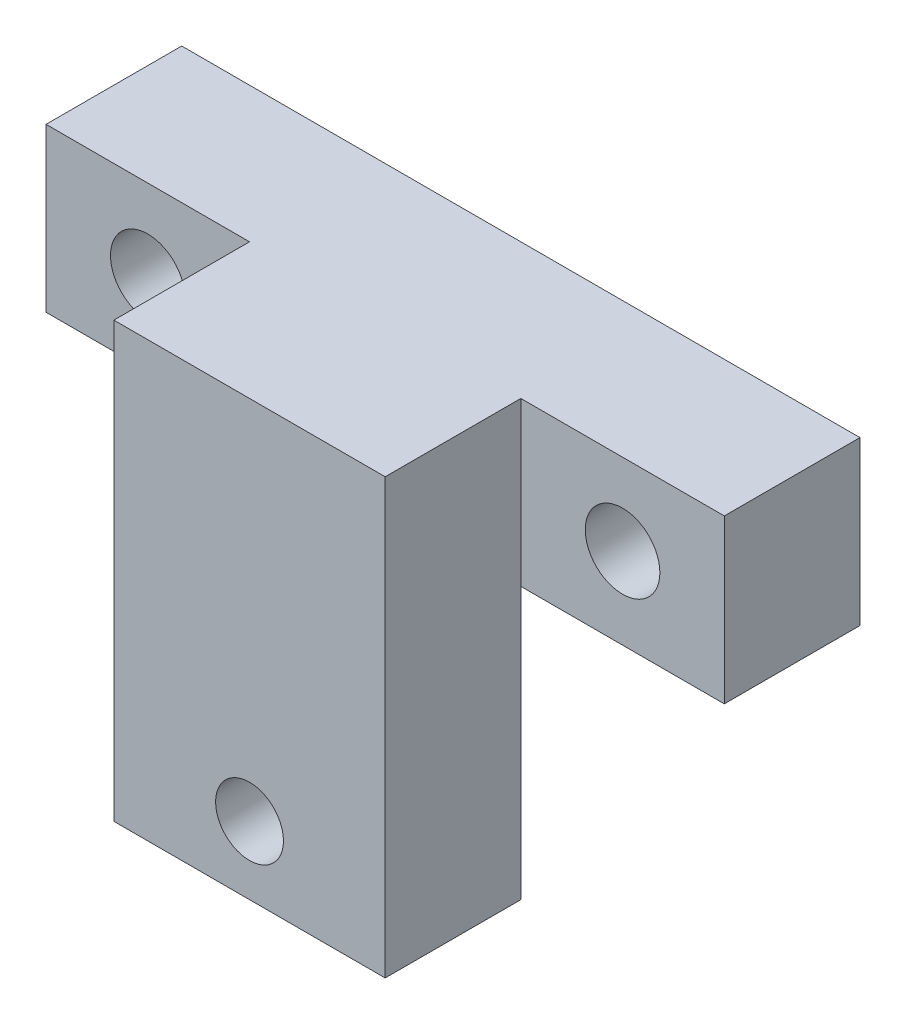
from build123d import *

# Parameters (mm, degrees)
SKETCH_1_R          = 2.75
SKETCH_1_R_2        = 2.5
EXTRUDE_1_DEPTH     = 20
CUT_EXTRUDE_START   = -35
SKETCH_2_OUTSIDE_W  = 34.528
SKETCH_2_OUTSIDE_H  = 46.528
CUT_EXTRUDE_1_DEPTH = 20
SKETCH_3_OUTSIDE_W  = 64.528
SKETCH_3_OUTSIDE_H  = 34.528
CUT_EXTRUDE_2_DEPTH = 20


with BuildPart() as part:
    # Sketch 1 → Extrude 1 (new body)
    with BuildSketch(Plane.XY):
        Polygon((15, 0), (15, 20), (0, 20), (0, 32), (50, 32), (50, 20), (35, 20), (35, 0), align=None)
        with Locations((7.5, 26)):
            Circle(SKETCH_1_R, mode=Mode.SUBTRACT)
        with Locations((42.5, 26)):
            Circle(SKETCH_1_R, mode=Mode.SUBTRACT)
        with Locations((25, 5)):
            Circle(SKETCH_1_R_2, mode=Mode.SUBTRACT)
    extrude(amount=EXTRUDE_1_DEPTH)

    # Sketch 2 outside → Cut-Extrude 1 (cut)
    with BuildSketch(Plane(origin=(50, 0, 0), x_dir=(0, 0, -1), z_dir=(1, 0, 0)).offset(CUT_EXTRUDE_START)):
        with Locations((-10, 16)):
            Rectangle(SKETCH_2_OUTSIDE_W, SKETCH_2_OUTSIDE_H)
        Polygon((0, 20), (0, 32), (-20, 32), (-20, 0), (-10, 0), (-10, 20), align=None, mode=Mode.SUBTRACT)
    extrude(amount=CUT_EXTRUDE_1_DEPTH, mode=Mode.SUBTRACT)

    # Sketch 3 outside → Cut-Extrude 2 (cut)
    with BuildSketch(Plane(origin=(0, 32, 0), x_dir=(1, 0, 0), z_dir=(0, 1, 0))):
        with Locations((25, -10)):
            Rectangle(SKETCH_3_OUTSIDE_W, SKETCH_3_OUTSIDE_H)
        Polygon((0, 0), (50, 0), (50, -10), (35, -10), (35, -20), (15, -20), (15, -10), (0, -10), align=None, mode=Mode.SUBTRACT)
    extrude(amount=-CUT_EXTRUDE_2_DEPTH, mode=Mode.SUBTRACT)


solid = part.part
